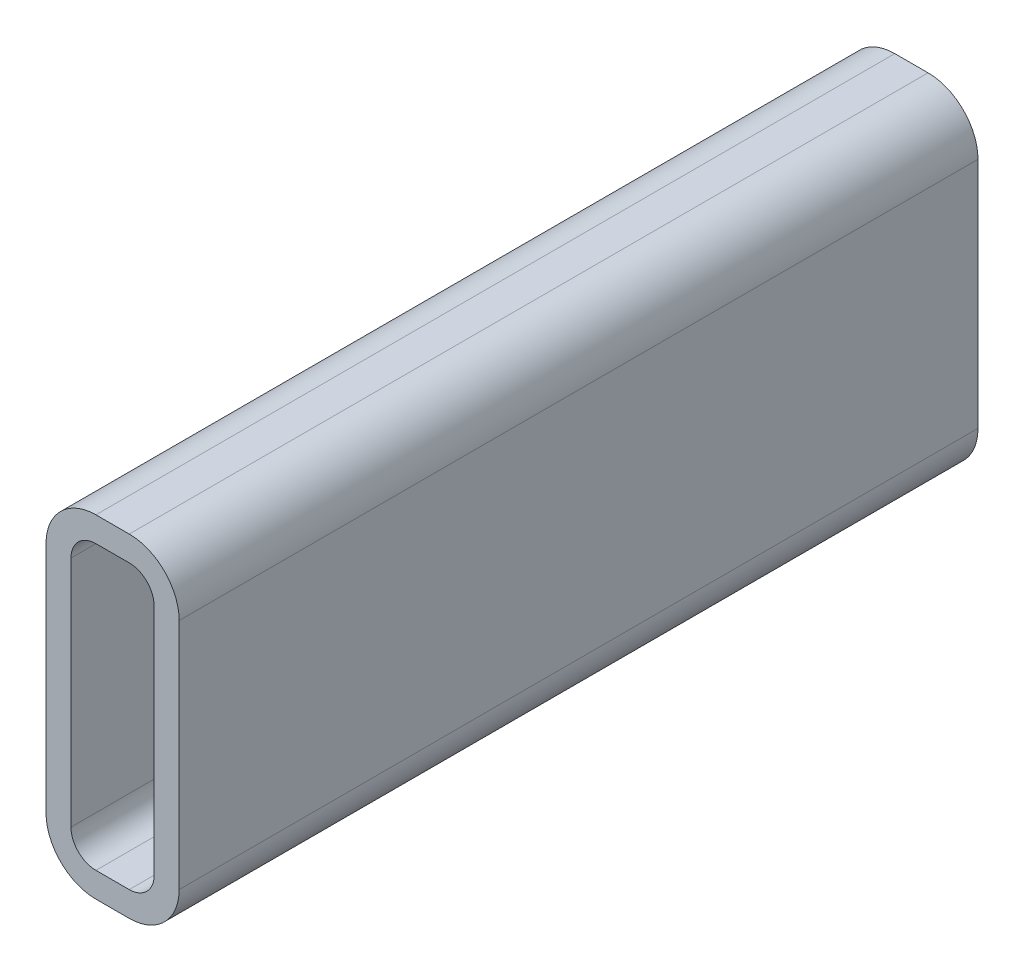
ISO-10303-21;
HEADER;
FILE_DESCRIPTION(('STEP AP214'),'2;1');
FILE_NAME('part.step','',(''),(''),'','','');
FILE_SCHEMA(('AUTOMOTIVE_DESIGN { 1 0 10303 214 1 1 1 1 }'));
ENDSEC;
DATA;
#1=APPLICATION_CONTEXT('core data for automotive mechanical design processes');
#2=APPLICATION_PROTOCOL_DEFINITION('international standard','automotive_design',2000,#1);
#3=PRODUCT_CONTEXT('',#1,'mechanical');
#4=PRODUCT('Part','Part','',(#3));
#5=PRODUCT_RELATED_PRODUCT_CATEGORY('part','',(#4));
#6=PRODUCT_DEFINITION_FORMATION('','',#4);
#7=PRODUCT_DEFINITION_CONTEXT('part definition',#1,'design');
#8=PRODUCT_DEFINITION('design','',#6,#7);
#9=PRODUCT_DEFINITION_SHAPE('','',#8);
#10=(LENGTH_UNIT() NAMED_UNIT(*) SI_UNIT(.MILLI.,.METRE.));
#11=(NAMED_UNIT(*) PLANE_ANGLE_UNIT() SI_UNIT($,.RADIAN.));
#12=(NAMED_UNIT(*) SI_UNIT($,.STERADIAN.) SOLID_ANGLE_UNIT());
#13=UNCERTAINTY_MEASURE_WITH_UNIT(LENGTH_MEASURE(1.E-05),#10,'distance_accuracy_value','');
#14=(GEOMETRIC_REPRESENTATION_CONTEXT(3) GLOBAL_UNCERTAINTY_ASSIGNED_CONTEXT((#13)) GLOBAL_UNIT_ASSIGNED_CONTEXT((#10,
#11,#12)) REPRESENTATION_CONTEXT('',''));
#15=CARTESIAN_POINT('',(0.,0.,0.));
#16=DIRECTION('',(0.,0.,1.));
#17=DIRECTION('',(1.,0.,0.));
#18=AXIS2_PLACEMENT_3D('',#15,#16,#17);
#19=CARTESIAN_POINT('',(19.0499999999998,107.95,304.8));
#20=DIRECTION('',(0.,0.,1.));
#21=DIRECTION('',(1.,0.,0.));
#22=AXIS2_PLACEMENT_3D('',#19,#20,#21);
#23=PLANE('',#22);
#24=CARTESIAN_POINT('',(19.0499999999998,107.95,304.8));
#25=DIRECTION('',(0.,0.,1.));
#26=DIRECTION('',(1.,0.,0.));
#27=AXIS2_PLACEMENT_3D('',#24,#25,#26);
#28=CIRCLE('',#27,19.0499999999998);
#29=CARTESIAN_POINT('',(19.05,127.,304.8));
#30=VERTEX_POINT('',#29);
#31=CARTESIAN_POINT('',(0.,107.95,304.8));
#32=VERTEX_POINT('',#31);
#33=EDGE_CURVE('E211',#30,#32,#28,.T.);
#34=ORIENTED_EDGE('',*,*,#33,.T.);
#35=DIRECTION('',(0.,-1.,0.));
#36=VECTOR('',#35,1.);
#37=CARTESIAN_POINT('',(0.,19.05,304.8));
#38=LINE('',#37,#36);
#39=CARTESIAN_POINT('',(0.,19.05,304.8));
#40=VERTEX_POINT('',#39);
#41=EDGE_CURVE('E214',#32,#40,#38,.T.);
#42=ORIENTED_EDGE('',*,*,#41,.T.);
#43=CARTESIAN_POINT('',(19.05,19.05,304.8));
#44=DIRECTION('',(0.,0.,1.));
#45=DIRECTION('',(1.,0.,0.));
#46=AXIS2_PLACEMENT_3D('',#43,#44,#45);
#47=CIRCLE('',#46,19.05);
#48=CARTESIAN_POINT('',(19.05,0.,304.8));
#49=VERTEX_POINT('',#48);
#50=EDGE_CURVE('E217',#40,#49,#47,.T.);
#51=ORIENTED_EDGE('',*,*,#50,.T.);
#52=DIRECTION('',(1.,0.,0.));
#53=VECTOR('',#52,1.);
#54=CARTESIAN_POINT('',(31.75,0.,304.8));
#55=LINE('',#54,#53);
#56=CARTESIAN_POINT('',(31.75,0.,304.8));
#57=VERTEX_POINT('',#56);
#58=EDGE_CURVE('E219',#49,#57,#55,.T.);
#59=ORIENTED_EDGE('',*,*,#58,.T.);
#60=CARTESIAN_POINT('',(31.75,19.05,304.8));
#61=DIRECTION('',(0.,0.,1.));
#62=DIRECTION('',(1.,0.,0.));
#63=AXIS2_PLACEMENT_3D('',#60,#61,#62);
#64=CIRCLE('',#63,19.05);
#65=CARTESIAN_POINT('',(50.8,19.05,304.8));
#66=VERTEX_POINT('',#65);
#67=EDGE_CURVE('E221',#57,#66,#64,.T.);
#68=ORIENTED_EDGE('',*,*,#67,.T.);
#69=DIRECTION('',(0.,1.,0.));
#70=VECTOR('',#69,1.);
#71=CARTESIAN_POINT('',(50.8,107.95,304.8));
#72=LINE('',#71,#70);
#73=CARTESIAN_POINT('',(50.8,107.95,304.8));
#74=VERTEX_POINT('',#73);
#75=EDGE_CURVE('E223',#66,#74,#72,.T.);
#76=ORIENTED_EDGE('',*,*,#75,.T.);
#77=CARTESIAN_POINT('',(31.75,107.95,304.8));
#78=DIRECTION('',(0.,0.,1.));
#79=DIRECTION('',(1.,0.,0.));
#80=AXIS2_PLACEMENT_3D('',#77,#78,#79);
#81=CIRCLE('',#80,19.05);
#82=CARTESIAN_POINT('',(31.75,127.,304.8));
#83=VERTEX_POINT('',#82);
#84=EDGE_CURVE('E225',#74,#83,#81,.T.);
#85=ORIENTED_EDGE('',*,*,#84,.T.);
#86=DIRECTION('',(-1.,0.,0.));
#87=VECTOR('',#86,1.);
#88=CARTESIAN_POINT('',(19.05,127.,304.8));
#89=LINE('',#88,#87);
#90=EDGE_CURVE('E227',#83,#30,#89,.T.);
#91=ORIENTED_EDGE('',*,*,#90,.T.);
#92=EDGE_LOOP('',(#34,#42,#51,#59,#68,#76,#85,#91));
#93=FACE_BOUND('',#92,.T.);
#94=DIRECTION('',(0.,-1.,0.));
#95=VECTOR('',#94,1.);
#96=CARTESIAN_POINT('',(9.525,19.05,304.8));
#97=LINE('',#96,#95);
#98=CARTESIAN_POINT('',(9.525,107.95,304.8));
#99=VERTEX_POINT('',#98);
#100=CARTESIAN_POINT('',(9.525,19.05,304.8));
#101=VERTEX_POINT('',#100);
#102=EDGE_CURVE('E154',#99,#101,#97,.T.);
#103=ORIENTED_EDGE('',*,*,#102,.F.);
#104=CARTESIAN_POINT('',(19.0499999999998,107.95,304.8));
#105=DIRECTION('',(0.,0.,1.));
#106=DIRECTION('',(1.,0.,0.));
#107=AXIS2_PLACEMENT_3D('',#104,#105,#106);
#108=CIRCLE('',#107,9.52499999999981);
#109=CARTESIAN_POINT('',(19.05,117.475,304.8));
#110=VERTEX_POINT('',#109);
#111=EDGE_CURVE('E146',#110,#99,#108,.T.);
#112=ORIENTED_EDGE('',*,*,#111,.F.);
#113=DIRECTION('',(-1.,0.,0.));
#114=VECTOR('',#113,1.);
#115=CARTESIAN_POINT('',(19.05,117.475,304.8));
#116=LINE('',#115,#114);
#117=CARTESIAN_POINT('',(31.75,117.475,304.8));
#118=VERTEX_POINT('',#117);
#119=EDGE_CURVE('E179',#118,#110,#116,.T.);
#120=ORIENTED_EDGE('',*,*,#119,.F.);
#121=CARTESIAN_POINT('',(31.75,107.95,304.8));
#122=DIRECTION('',(0.,0.,1.));
#123=DIRECTION('',(1.,0.,0.));
#124=AXIS2_PLACEMENT_3D('',#121,#122,#123);
#125=CIRCLE('',#124,9.52499999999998);
#126=CARTESIAN_POINT('',(41.275,107.95,304.8));
#127=VERTEX_POINT('',#126);
#128=EDGE_CURVE('E177',#127,#118,#125,.T.);
#129=ORIENTED_EDGE('',*,*,#128,.F.);
#130=DIRECTION('',(0.,1.,0.));
#131=VECTOR('',#130,1.);
#132=CARTESIAN_POINT('',(41.275,107.95,304.8));
#133=LINE('',#132,#131);
#134=CARTESIAN_POINT('',(41.275,19.05,304.8));
#135=VERTEX_POINT('',#134);
#136=EDGE_CURVE('E175',#135,#127,#133,.T.);
#137=ORIENTED_EDGE('',*,*,#136,.F.);
#138=CARTESIAN_POINT('',(31.75,19.05,304.8));
#139=DIRECTION('',(0.,0.,1.));
#140=DIRECTION('',(1.,0.,0.));
#141=AXIS2_PLACEMENT_3D('',#138,#139,#140);
#142=CIRCLE('',#141,9.525);
#143=CARTESIAN_POINT('',(31.75,9.525,304.8));
#144=VERTEX_POINT('',#143);
#145=EDGE_CURVE('E173',#144,#135,#142,.T.);
#146=ORIENTED_EDGE('',*,*,#145,.F.);
#147=DIRECTION('',(1.,0.,0.));
#148=VECTOR('',#147,1.);
#149=CARTESIAN_POINT('',(31.75,9.525,304.8));
#150=LINE('',#149,#148);
#151=CARTESIAN_POINT('',(19.05,9.525,304.8));
#152=VERTEX_POINT('',#151);
#153=EDGE_CURVE('E169',#152,#144,#150,.T.);
#154=ORIENTED_EDGE('',*,*,#153,.F.);
#155=CARTESIAN_POINT('',(19.05,19.05,304.8));
#156=DIRECTION('',(0.,0.,1.));
#157=DIRECTION('',(1.,0.,0.));
#158=AXIS2_PLACEMENT_3D('',#155,#156,#157);
#159=CIRCLE('',#158,9.525);
#160=EDGE_CURVE('E167',#101,#152,#159,.T.);
#161=ORIENTED_EDGE('',*,*,#160,.F.);
#162=EDGE_LOOP('',(#103,#112,#120,#129,#137,#146,#154,#161));
#163=FACE_BOUND('',#162,.T.);
#164=ADVANCED_FACE('F33',(#93,#163),#23,.T.);
#165=CARTESIAN_POINT('',(19.0499999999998,107.95,0.));
#166=DIRECTION('',(0.,0.,1.));
#167=DIRECTION('',(1.,0.,0.));
#168=AXIS2_PLACEMENT_3D('',#165,#166,#167);
#169=PLANE('',#168);
#170=CARTESIAN_POINT('',(19.0499999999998,107.95,0.));
#171=DIRECTION('',(0.,0.,1.));
#172=DIRECTION('',(1.,0.,0.));
#173=AXIS2_PLACEMENT_3D('',#170,#171,#172);
#174=CIRCLE('',#173,19.0499999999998);
#175=CARTESIAN_POINT('',(19.05,127.,0.));
#176=VERTEX_POINT('',#175);
#177=CARTESIAN_POINT('',(0.,107.95,0.));
#178=VERTEX_POINT('',#177);
#179=EDGE_CURVE('E162',#176,#178,#174,.T.);
#180=ORIENTED_EDGE('',*,*,#179,.F.);
#181=DIRECTION('',(-1.,0.,0.));
#182=VECTOR('',#181,1.);
#183=CARTESIAN_POINT('',(19.05,127.,0.));
#184=LINE('',#183,#182);
#185=CARTESIAN_POINT('',(31.75,127.,0.));
#186=VERTEX_POINT('',#185);
#187=EDGE_CURVE('E215',#186,#176,#184,.T.);
#188=ORIENTED_EDGE('',*,*,#187,.F.);
#189=CARTESIAN_POINT('',(31.75,107.95,0.));
#190=DIRECTION('',(0.,0.,1.));
#191=DIRECTION('',(1.,0.,0.));
#192=AXIS2_PLACEMENT_3D('',#189,#190,#191);
#193=CIRCLE('',#192,19.05);
#194=CARTESIAN_POINT('',(50.8,107.95,0.));
#195=VERTEX_POINT('',#194);
#196=EDGE_CURVE('E242',#195,#186,#193,.T.);
#197=ORIENTED_EDGE('',*,*,#196,.F.);
#198=DIRECTION('',(0.,1.,0.));
#199=VECTOR('',#198,1.);
#200=CARTESIAN_POINT('',(50.8,107.95,0.));
#201=LINE('',#200,#199);
#202=CARTESIAN_POINT('',(50.8,19.05,0.));
#203=VERTEX_POINT('',#202);
#204=EDGE_CURVE('E240',#203,#195,#201,.T.);
#205=ORIENTED_EDGE('',*,*,#204,.F.);
#206=CARTESIAN_POINT('',(31.75,19.05,0.));
#207=DIRECTION('',(0.,0.,1.));
#208=DIRECTION('',(1.,0.,0.));
#209=AXIS2_PLACEMENT_3D('',#206,#207,#208);
#210=CIRCLE('',#209,19.05);
#211=CARTESIAN_POINT('',(31.75,0.,0.));
#212=VERTEX_POINT('',#211);
#213=EDGE_CURVE('E238',#212,#203,#210,.T.);
#214=ORIENTED_EDGE('',*,*,#213,.F.);
#215=DIRECTION('',(1.,0.,0.));
#216=VECTOR('',#215,1.);
#217=CARTESIAN_POINT('',(31.75,0.,0.));
#218=LINE('',#217,#216);
#219=CARTESIAN_POINT('',(19.05,0.,0.));
#220=VERTEX_POINT('',#219);
#221=EDGE_CURVE('E236',#220,#212,#218,.T.);
#222=ORIENTED_EDGE('',*,*,#221,.F.);
#223=CARTESIAN_POINT('',(19.05,19.05,0.));
#224=DIRECTION('',(0.,0.,1.));
#225=DIRECTION('',(1.,0.,0.));
#226=AXIS2_PLACEMENT_3D('',#223,#224,#225);
#227=CIRCLE('',#226,19.05);
#228=CARTESIAN_POINT('',(0.,19.05,0.));
#229=VERTEX_POINT('',#228);
#230=EDGE_CURVE('E234',#229,#220,#227,.T.);
#231=ORIENTED_EDGE('',*,*,#230,.F.);
#232=DIRECTION('',(0.,-1.,0.));
#233=VECTOR('',#232,1.);
#234=CARTESIAN_POINT('',(0.,19.05,0.));
#235=LINE('',#234,#233);
#236=EDGE_CURVE('E232',#178,#229,#235,.T.);
#237=ORIENTED_EDGE('',*,*,#236,.F.);
#238=EDGE_LOOP('',(#180,#188,#197,#205,#214,#222,#231,#237));
#239=FACE_BOUND('',#238,.T.);
#240=CARTESIAN_POINT('',(19.0499999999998,107.95,0.));
#241=DIRECTION('',(0.,0.,1.));
#242=DIRECTION('',(1.,0.,0.));
#243=AXIS2_PLACEMENT_3D('',#240,#241,#242);
#244=CIRCLE('',#243,9.52499999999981);
#245=CARTESIAN_POINT('',(19.05,117.475,0.));
#246=VERTEX_POINT('',#245);
#247=CARTESIAN_POINT('',(9.525,107.95,0.));
#248=VERTEX_POINT('',#247);
#249=EDGE_CURVE('E56',#246,#248,#244,.T.);
#250=ORIENTED_EDGE('',*,*,#249,.T.);
#251=DIRECTION('',(0.,-1.,0.));
#252=VECTOR('',#251,1.);
#253=CARTESIAN_POINT('',(9.525,19.05,0.));
#254=LINE('',#253,#252);
#255=CARTESIAN_POINT('',(9.525,19.05,0.));
#256=VERTEX_POINT('',#255);
#257=EDGE_CURVE('E161',#248,#256,#254,.T.);
#258=ORIENTED_EDGE('',*,*,#257,.T.);
#259=CARTESIAN_POINT('',(19.05,19.05,0.));
#260=DIRECTION('',(0.,0.,1.));
#261=DIRECTION('',(1.,0.,0.));
#262=AXIS2_PLACEMENT_3D('',#259,#260,#261);
#263=CIRCLE('',#262,9.525);
#264=CARTESIAN_POINT('',(19.05,9.525,0.));
#265=VERTEX_POINT('',#264);
#266=EDGE_CURVE('E183',#256,#265,#263,.T.);
#267=ORIENTED_EDGE('',*,*,#266,.T.);
#268=DIRECTION('',(1.,0.,0.));
#269=VECTOR('',#268,1.);
#270=CARTESIAN_POINT('',(31.75,9.525,0.));
#271=LINE('',#270,#269);
#272=CARTESIAN_POINT('',(31.75,9.525,0.));
#273=VERTEX_POINT('',#272);
#274=EDGE_CURVE('E186',#265,#273,#271,.T.);
#275=ORIENTED_EDGE('',*,*,#274,.T.);
#276=CARTESIAN_POINT('',(31.75,19.05,0.));
#277=DIRECTION('',(0.,0.,1.));
#278=DIRECTION('',(1.,0.,0.));
#279=AXIS2_PLACEMENT_3D('',#276,#277,#278);
#280=CIRCLE('',#279,9.525);
#281=CARTESIAN_POINT('',(41.275,19.05,0.));
#282=VERTEX_POINT('',#281);
#283=EDGE_CURVE('E189',#273,#282,#280,.T.);
#284=ORIENTED_EDGE('',*,*,#283,.T.);
#285=DIRECTION('',(0.,1.,0.));
#286=VECTOR('',#285,1.);
#287=CARTESIAN_POINT('',(41.275,107.95,0.));
#288=LINE('',#287,#286);
#289=CARTESIAN_POINT('',(41.275,107.95,0.));
#290=VERTEX_POINT('',#289);
#291=EDGE_CURVE('E192',#282,#290,#288,.T.);
#292=ORIENTED_EDGE('',*,*,#291,.T.);
#293=CARTESIAN_POINT('',(31.75,107.95,0.));
#294=DIRECTION('',(0.,0.,1.));
#295=DIRECTION('',(1.,0.,0.));
#296=AXIS2_PLACEMENT_3D('',#293,#294,#295);
#297=CIRCLE('',#296,9.52499999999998);
#298=CARTESIAN_POINT('',(31.75,117.475,0.));
#299=VERTEX_POINT('',#298);
#300=EDGE_CURVE('E195',#290,#299,#297,.T.);
#301=ORIENTED_EDGE('',*,*,#300,.T.);
#302=DIRECTION('',(-1.,0.,0.));
#303=VECTOR('',#302,1.);
#304=CARTESIAN_POINT('',(19.05,117.475,0.));
#305=LINE('',#304,#303);
#306=EDGE_CURVE('E155',#299,#246,#305,.T.);
#307=ORIENTED_EDGE('',*,*,#306,.T.);
#308=EDGE_LOOP('',(#250,#258,#267,#275,#284,#292,#301,#307));
#309=FACE_BOUND('',#308,.T.);
#310=ADVANCED_FACE('F272',(#239,#309),#169,.F.);
#311=CARTESIAN_POINT('',(19.0499999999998,107.95,304.8));
#312=DIRECTION('',(0.,0.,-1.));
#313=DIRECTION('',(-1.,0.,0.));
#314=AXIS2_PLACEMENT_3D('',#311,#312,#313);
#315=CYLINDRICAL_SURFACE('',#314,19.0499999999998);
#316=ORIENTED_EDGE('',*,*,#179,.T.);
#317=DIRECTION('',(0.,0.,-1.));
#318=VECTOR('',#317,1.);
#319=CARTESIAN_POINT('',(0.,107.95,304.8));
#320=LINE('',#319,#318);
#321=EDGE_CURVE('E11',#32,#178,#320,.T.);
#322=ORIENTED_EDGE('',*,*,#321,.F.);
#323=ORIENTED_EDGE('',*,*,#33,.F.);
#324=DIRECTION('',(0.,0.,-1.));
#325=VECTOR('',#324,1.);
#326=CARTESIAN_POINT('',(19.05,127.,304.8));
#327=LINE('',#326,#325);
#328=EDGE_CURVE('E229',#30,#176,#327,.T.);
#329=ORIENTED_EDGE('',*,*,#328,.T.);
#330=EDGE_LOOP('',(#316,#322,#323,#329));
#331=FACE_BOUND('',#330,.T.);
#332=ADVANCED_FACE('F35',(#331),#315,.T.);
#333=CARTESIAN_POINT('',(0.,19.05,304.8));
#334=DIRECTION('',(1.,0.,0.));
#335=DIRECTION('',(0.,0.,-1.));
#336=AXIS2_PLACEMENT_3D('',#333,#334,#335);
#337=PLANE('',#336);
#338=ORIENTED_EDGE('',*,*,#236,.T.);
#339=DIRECTION('',(0.,0.,-1.));
#340=VECTOR('',#339,1.);
#341=CARTESIAN_POINT('',(0.,19.05,304.8));
#342=LINE('',#341,#340);
#343=EDGE_CURVE('E41',#40,#229,#342,.T.);
#344=ORIENTED_EDGE('',*,*,#343,.F.);
#345=ORIENTED_EDGE('',*,*,#41,.F.);
#346=ORIENTED_EDGE('',*,*,#321,.T.);
#347=EDGE_LOOP('',(#338,#344,#345,#346));
#348=FACE_BOUND('',#347,.T.);
#349=ADVANCED_FACE('F289',(#348),#337,.F.);
#350=CARTESIAN_POINT('',(19.05,19.05,304.8));
#351=DIRECTION('',(0.,0.,-1.));
#352=DIRECTION('',(-1.,0.,0.));
#353=AXIS2_PLACEMENT_3D('',#350,#351,#352);
#354=CYLINDRICAL_SURFACE('',#353,19.05);
#355=ORIENTED_EDGE('',*,*,#230,.T.);
#356=DIRECTION('',(0.,0.,-1.));
#357=VECTOR('',#356,1.);
#358=CARTESIAN_POINT('',(19.05,0.,304.8));
#359=LINE('',#358,#357);
#360=EDGE_CURVE('E259',#49,#220,#359,.T.);
#361=ORIENTED_EDGE('',*,*,#360,.F.);
#362=ORIENTED_EDGE('',*,*,#50,.F.);
#363=ORIENTED_EDGE('',*,*,#343,.T.);
#364=EDGE_LOOP('',(#355,#361,#362,#363));
#365=FACE_BOUND('',#364,.T.);
#366=ADVANCED_FACE('F266',(#365),#354,.T.);
#367=CARTESIAN_POINT('',(31.75,0.,304.8));
#368=DIRECTION('',(0.,1.,0.));
#369=DIRECTION('',(0.,0.,1.));
#370=AXIS2_PLACEMENT_3D('',#367,#368,#369);
#371=PLANE('',#370);
#372=ORIENTED_EDGE('',*,*,#221,.T.);
#373=DIRECTION('',(0.,0.,-1.));
#374=VECTOR('',#373,1.);
#375=CARTESIAN_POINT('',(31.75,0.,304.8));
#376=LINE('',#375,#374);
#377=EDGE_CURVE('E256',#57,#212,#376,.T.);
#378=ORIENTED_EDGE('',*,*,#377,.F.);
#379=ORIENTED_EDGE('',*,*,#58,.F.);
#380=ORIENTED_EDGE('',*,*,#360,.T.);
#381=EDGE_LOOP('',(#372,#378,#379,#380));
#382=FACE_BOUND('',#381,.T.);
#383=ADVANCED_FACE('F278',(#382),#371,.F.);
#384=CARTESIAN_POINT('',(31.75,19.05,304.8));
#385=DIRECTION('',(0.,0.,-1.));
#386=DIRECTION('',(-1.,0.,0.));
#387=AXIS2_PLACEMENT_3D('',#384,#385,#386);
#388=CYLINDRICAL_SURFACE('',#387,19.05);
#389=ORIENTED_EDGE('',*,*,#213,.T.);
#390=DIRECTION('',(0.,0.,-1.));
#391=VECTOR('',#390,1.);
#392=CARTESIAN_POINT('',(50.8,19.05,304.8));
#393=LINE('',#392,#391);
#394=EDGE_CURVE('E253',#66,#203,#393,.T.);
#395=ORIENTED_EDGE('',*,*,#394,.F.);
#396=ORIENTED_EDGE('',*,*,#67,.F.);
#397=ORIENTED_EDGE('',*,*,#377,.T.);
#398=EDGE_LOOP('',(#389,#395,#396,#397));
#399=FACE_BOUND('',#398,.T.);
#400=ADVANCED_FACE('F282',(#399),#388,.T.);
#401=CARTESIAN_POINT('',(50.8,107.95,304.8));
#402=DIRECTION('',(-1.,0.,0.));
#403=DIRECTION('',(0.,0.,1.));
#404=AXIS2_PLACEMENT_3D('',#401,#402,#403);
#405=PLANE('',#404);
#406=ORIENTED_EDGE('',*,*,#204,.T.);
#407=DIRECTION('',(0.,0.,-1.));
#408=VECTOR('',#407,1.);
#409=CARTESIAN_POINT('',(50.8,107.95,304.8));
#410=LINE('',#409,#408);
#411=EDGE_CURVE('E250',#74,#195,#410,.T.);
#412=ORIENTED_EDGE('',*,*,#411,.F.);
#413=ORIENTED_EDGE('',*,*,#75,.F.);
#414=ORIENTED_EDGE('',*,*,#394,.T.);
#415=EDGE_LOOP('',(#406,#412,#413,#414));
#416=FACE_BOUND('',#415,.T.);
#417=ADVANCED_FACE('F302',(#416),#405,.F.);
#418=CARTESIAN_POINT('',(31.75,107.95,304.8));
#419=DIRECTION('',(0.,0.,-1.));
#420=DIRECTION('',(-1.,0.,0.));
#421=AXIS2_PLACEMENT_3D('',#418,#419,#420);
#422=CYLINDRICAL_SURFACE('',#421,19.05);
#423=ORIENTED_EDGE('',*,*,#196,.T.);
#424=DIRECTION('',(0.,0.,-1.));
#425=VECTOR('',#424,1.);
#426=CARTESIAN_POINT('',(31.75,127.,304.8));
#427=LINE('',#426,#425);
#428=EDGE_CURVE('E247',#83,#186,#427,.T.);
#429=ORIENTED_EDGE('',*,*,#428,.F.);
#430=ORIENTED_EDGE('',*,*,#84,.F.);
#431=ORIENTED_EDGE('',*,*,#411,.T.);
#432=EDGE_LOOP('',(#423,#429,#430,#431));
#433=FACE_BOUND('',#432,.T.);
#434=ADVANCED_FACE('F300',(#433),#422,.T.);
#435=CARTESIAN_POINT('',(19.05,127.,304.8));
#436=DIRECTION('',(0.,-1.,0.));
#437=DIRECTION('',(0.,0.,-1.));
#438=AXIS2_PLACEMENT_3D('',#435,#436,#437);
#439=PLANE('',#438);
#440=ORIENTED_EDGE('',*,*,#187,.T.);
#441=ORIENTED_EDGE('',*,*,#328,.F.);
#442=ORIENTED_EDGE('',*,*,#90,.F.);
#443=ORIENTED_EDGE('',*,*,#428,.T.);
#444=EDGE_LOOP('',(#440,#441,#442,#443));
#445=FACE_BOUND('',#444,.T.);
#446=ADVANCED_FACE('F295',(#445),#439,.F.);
#447=CARTESIAN_POINT('',(19.0499999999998,107.95,304.8));
#448=DIRECTION('',(0.,0.,-1.));
#449=DIRECTION('',(-1.,0.,0.));
#450=AXIS2_PLACEMENT_3D('',#447,#448,#449);
#451=CYLINDRICAL_SURFACE('',#450,9.52499999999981);
#452=ORIENTED_EDGE('',*,*,#249,.F.);
#453=DIRECTION('',(0.,0.,-1.));
#454=VECTOR('',#453,1.);
#455=CARTESIAN_POINT('',(19.05,117.475,304.8));
#456=LINE('',#455,#454);
#457=EDGE_CURVE('E150',#110,#246,#456,.T.);
#458=ORIENTED_EDGE('',*,*,#457,.F.);
#459=ORIENTED_EDGE('',*,*,#111,.T.);
#460=DIRECTION('',(0.,0.,-1.));
#461=VECTOR('',#460,1.);
#462=CARTESIAN_POINT('',(9.525,107.95,304.8));
#463=LINE('',#462,#461);
#464=EDGE_CURVE('E149',#99,#248,#463,.T.);
#465=ORIENTED_EDGE('',*,*,#464,.T.);
#466=EDGE_LOOP('',(#452,#458,#459,#465));
#467=FACE_BOUND('',#466,.T.);
#468=ADVANCED_FACE('F148',(#467),#451,.F.);
#469=CARTESIAN_POINT('',(9.525,19.05,304.8));
#470=DIRECTION('',(1.,0.,0.));
#471=DIRECTION('',(0.,0.,-1.));
#472=AXIS2_PLACEMENT_3D('',#469,#470,#471);
#473=PLANE('',#472);
#474=ORIENTED_EDGE('',*,*,#257,.F.);
#475=ORIENTED_EDGE('',*,*,#464,.F.);
#476=ORIENTED_EDGE('',*,*,#102,.T.);
#477=DIRECTION('',(0.,0.,-1.));
#478=VECTOR('',#477,1.);
#479=CARTESIAN_POINT('',(9.525,19.05,304.8));
#480=LINE('',#479,#478);
#481=EDGE_CURVE('E163',#101,#256,#480,.T.);
#482=ORIENTED_EDGE('',*,*,#481,.T.);
#483=EDGE_LOOP('',(#474,#475,#476,#482));
#484=FACE_BOUND('',#483,.T.);
#485=ADVANCED_FACE('F158',(#484),#473,.T.);
#486=CARTESIAN_POINT('',(19.05,19.05,304.8));
#487=DIRECTION('',(0.,0.,-1.));
#488=DIRECTION('',(-1.,0.,0.));
#489=AXIS2_PLACEMENT_3D('',#486,#487,#488);
#490=CYLINDRICAL_SURFACE('',#489,9.525);
#491=ORIENTED_EDGE('',*,*,#266,.F.);
#492=ORIENTED_EDGE('',*,*,#481,.F.);
#493=ORIENTED_EDGE('',*,*,#160,.T.);
#494=DIRECTION('',(0.,0.,-1.));
#495=VECTOR('',#494,1.);
#496=CARTESIAN_POINT('',(19.05,9.525,304.8));
#497=LINE('',#496,#495);
#498=EDGE_CURVE('E208',#152,#265,#497,.T.);
#499=ORIENTED_EDGE('',*,*,#498,.T.);
#500=EDGE_LOOP('',(#491,#492,#493,#499));
#501=FACE_BOUND('',#500,.T.);
#502=ADVANCED_FACE('F327',(#501),#490,.F.);
#503=CARTESIAN_POINT('',(31.75,9.525,304.8));
#504=DIRECTION('',(0.,1.,0.));
#505=DIRECTION('',(0.,0.,1.));
#506=AXIS2_PLACEMENT_3D('',#503,#504,#505);
#507=PLANE('',#506);
#508=ORIENTED_EDGE('',*,*,#274,.F.);
#509=ORIENTED_EDGE('',*,*,#498,.F.);
#510=ORIENTED_EDGE('',*,*,#153,.T.);
#511=DIRECTION('',(0.,0.,-1.));
#512=VECTOR('',#511,1.);
#513=CARTESIAN_POINT('',(31.75,9.525,304.8));
#514=LINE('',#513,#512);
#515=EDGE_CURVE('E206',#144,#273,#514,.T.);
#516=ORIENTED_EDGE('',*,*,#515,.T.);
#517=EDGE_LOOP('',(#508,#509,#510,#516));
#518=FACE_BOUND('',#517,.T.);
#519=ADVANCED_FACE('F331',(#518),#507,.T.);
#520=CARTESIAN_POINT('',(31.75,19.05,304.8));
#521=DIRECTION('',(0.,0.,-1.));
#522=DIRECTION('',(-1.,0.,0.));
#523=AXIS2_PLACEMENT_3D('',#520,#521,#522);
#524=CYLINDRICAL_SURFACE('',#523,9.525);
#525=ORIENTED_EDGE('',*,*,#283,.F.);
#526=ORIENTED_EDGE('',*,*,#515,.F.);
#527=ORIENTED_EDGE('',*,*,#145,.T.);
#528=DIRECTION('',(0.,0.,-1.));
#529=VECTOR('',#528,1.);
#530=CARTESIAN_POINT('',(41.275,19.05,304.8));
#531=LINE('',#530,#529);
#532=EDGE_CURVE('E204',#135,#282,#531,.T.);
#533=ORIENTED_EDGE('',*,*,#532,.T.);
#534=EDGE_LOOP('',(#525,#526,#527,#533));
#535=FACE_BOUND('',#534,.T.);
#536=ADVANCED_FACE('F337',(#535),#524,.F.);
#537=CARTESIAN_POINT('',(41.275,107.95,304.8));
#538=DIRECTION('',(-1.,0.,0.));
#539=DIRECTION('',(0.,0.,1.));
#540=AXIS2_PLACEMENT_3D('',#537,#538,#539);
#541=PLANE('',#540);
#542=ORIENTED_EDGE('',*,*,#291,.F.);
#543=ORIENTED_EDGE('',*,*,#532,.F.);
#544=ORIENTED_EDGE('',*,*,#136,.T.);
#545=DIRECTION('',(0.,0.,-1.));
#546=VECTOR('',#545,1.);
#547=CARTESIAN_POINT('',(41.275,107.95,304.8));
#548=LINE('',#547,#546);
#549=EDGE_CURVE('E202',#127,#290,#548,.T.);
#550=ORIENTED_EDGE('',*,*,#549,.T.);
#551=EDGE_LOOP('',(#542,#543,#544,#550));
#552=FACE_BOUND('',#551,.T.);
#553=ADVANCED_FACE('F341',(#552),#541,.T.);
#554=CARTESIAN_POINT('',(31.75,107.95,304.8));
#555=DIRECTION('',(0.,0.,-1.));
#556=DIRECTION('',(-1.,0.,0.));
#557=AXIS2_PLACEMENT_3D('',#554,#555,#556);
#558=CYLINDRICAL_SURFACE('',#557,9.52499999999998);
#559=ORIENTED_EDGE('',*,*,#300,.F.);
#560=ORIENTED_EDGE('',*,*,#549,.F.);
#561=ORIENTED_EDGE('',*,*,#128,.T.);
#562=DIRECTION('',(0.,0.,-1.));
#563=VECTOR('',#562,1.);
#564=CARTESIAN_POINT('',(31.75,117.475,304.8));
#565=LINE('',#564,#563);
#566=EDGE_CURVE('E48',#118,#299,#565,.T.);
#567=ORIENTED_EDGE('',*,*,#566,.T.);
#568=EDGE_LOOP('',(#559,#560,#561,#567));
#569=FACE_BOUND('',#568,.T.);
#570=ADVANCED_FACE('F345',(#569),#558,.F.);
#571=CARTESIAN_POINT('',(19.05,117.475,304.8));
#572=DIRECTION('',(0.,-1.,0.));
#573=DIRECTION('',(0.,0.,-1.));
#574=AXIS2_PLACEMENT_3D('',#571,#572,#573);
#575=PLANE('',#574);
#576=ORIENTED_EDGE('',*,*,#306,.F.);
#577=ORIENTED_EDGE('',*,*,#566,.F.);
#578=ORIENTED_EDGE('',*,*,#119,.T.);
#579=ORIENTED_EDGE('',*,*,#457,.T.);
#580=EDGE_LOOP('',(#576,#577,#578,#579));
#581=FACE_BOUND('',#580,.T.);
#582=ADVANCED_FACE('F349',(#581),#575,.T.);
#583=CLOSED_SHELL('',(#164,#310,#332,#349,#366,#383,#400,#417,#434,#446,#468,#485,#502,#519,
#536,#553,#570,#582));
#584=MANIFOLD_SOLID_BREP('B2',#583);
#585=ADVANCED_BREP_SHAPE_REPRESENTATION('',(#18,#584),#14);
#586=SHAPE_DEFINITION_REPRESENTATION(#9,#585);
ENDSEC;
END-ISO-10303-21;
